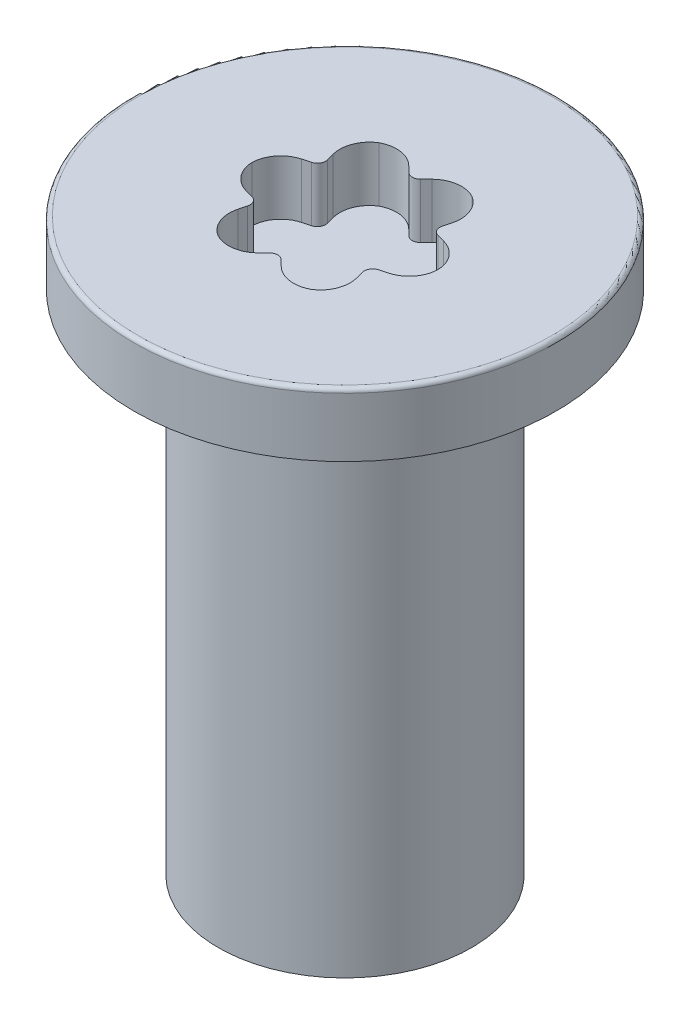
ISO-10303-21;
HEADER;
FILE_DESCRIPTION(('STEP AP214'),'2;1');
FILE_NAME('part.step','',(''),(''),'','','');
FILE_SCHEMA(('AUTOMOTIVE_DESIGN { 1 0 10303 214 1 1 1 1 }'));
ENDSEC;
DATA;
#1=APPLICATION_CONTEXT('core data for automotive mechanical design processes');
#2=APPLICATION_PROTOCOL_DEFINITION('international standard','automotive_design',2000,#1);
#3=PRODUCT_CONTEXT('',#1,'mechanical');
#4=PRODUCT('Part','Part','',(#3));
#5=PRODUCT_RELATED_PRODUCT_CATEGORY('part','',(#4));
#6=PRODUCT_DEFINITION_FORMATION('','',#4);
#7=PRODUCT_DEFINITION_CONTEXT('part definition',#1,'design');
#8=PRODUCT_DEFINITION('design','',#6,#7);
#9=PRODUCT_DEFINITION_SHAPE('','',#8);
#10=(LENGTH_UNIT() NAMED_UNIT(*) SI_UNIT(.MILLI.,.METRE.));
#11=(NAMED_UNIT(*) PLANE_ANGLE_UNIT() SI_UNIT($,.RADIAN.));
#12=(NAMED_UNIT(*) SI_UNIT($,.STERADIAN.) SOLID_ANGLE_UNIT());
#13=UNCERTAINTY_MEASURE_WITH_UNIT(LENGTH_MEASURE(1.E-05),#10,'distance_accuracy_value','');
#14=(GEOMETRIC_REPRESENTATION_CONTEXT(3) GLOBAL_UNCERTAINTY_ASSIGNED_CONTEXT((#13)) GLOBAL_UNIT_ASSIGNED_CONTEXT((#10,
#11,#12)) REPRESENTATION_CONTEXT('',''));
#15=CARTESIAN_POINT('',(0.,0.,0.));
#16=DIRECTION('',(0.,0.,1.));
#17=DIRECTION('',(1.,0.,0.));
#18=AXIS2_PLACEMENT_3D('',#15,#16,#17);
#19=CARTESIAN_POINT('',(-4.9,13.5,0.));
#20=DIRECTION('',(0.,-1.,0.));
#21=DIRECTION('',(0.,0.,-1.));
#22=AXIS2_PLACEMENT_3D('',#19,#20,#21);
#23=PLANE('',#22);
#24=CARTESIAN_POINT('',(0.,13.5,0.));
#25=DIRECTION('',(0.,-1.,0.));
#26=DIRECTION('',(0.,0.,-1.));
#27=AXIS2_PLACEMENT_3D('',#24,#25,#26);
#28=CIRCLE('',#27,4.9);
#29=CARTESIAN_POINT('',(0.,13.5,-4.9));
#30=VERTEX_POINT('',#29);
#31=EDGE_CURVE('E459',#30,#30,#28,.T.);
#32=ORIENTED_EDGE('',*,*,#31,.F.);
#33=EDGE_LOOP('',(#32));
#34=FACE_BOUND('',#33,.T.);
#35=DIRECTION('',(0.258819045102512,0.,-0.965925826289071));
#36=VECTOR('',#35,1.);
#37=CARTESIAN_POINT('',(-1.03134917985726,13.5,-0.276349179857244));
#38=LINE('',#37,#36);
#39=CARTESIAN_POINT('',(-1.40773060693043,13.5,1.12832542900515));
#40=VERTEX_POINT('',#39);
#41=CARTESIAN_POINT('',(-1.359462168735,13.5,0.948185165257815));
#42=VERTEX_POINT('',#41);
#43=EDGE_CURVE('E442',#40,#42,#38,.T.);
#44=ORIENTED_EDGE('',*,*,#43,.T.);
#45=CARTESIAN_POINT('',(-1.55264733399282,13.5,0.896421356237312));
#46=DIRECTION('',(0.,-1.,0.));
#47=DIRECTION('',(0.,0.,-1.));
#48=AXIS2_PLACEMENT_3D('',#45,#46,#47);
#49=CIRCLE('',#48,0.2);
#50=CARTESIAN_POINT('',(-1.50088352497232,13.5,0.703236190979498));
#51=VERTEX_POINT('',#50);
#52=EDGE_CURVE('E377',#42,#51,#49,.F.);
#53=ORIENTED_EDGE('',*,*,#52,.T.);
#54=DIRECTION('',(-0.96592582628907,0.,-0.258819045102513));
#55=VECTOR('',#54,1.);
#56=CARTESIAN_POINT('',(-0.276349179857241,13.5,1.03134917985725));
#57=LINE('',#56,#55);
#58=CARTESIAN_POINT('',(-1.68102378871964,13.5,0.654967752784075));
#59=VERTEX_POINT('',#58);
#60=EDGE_CURVE('E252',#51,#59,#57,.T.);
#61=ORIENTED_EDGE('',*,*,#60,.T.);
#62=CARTESIAN_POINT('',(-1.49985045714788,13.5,-0.021180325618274));
#63=DIRECTION('',(0.,-1.,0.));
#64=DIRECTION('',(0.,0.,-1.));
#65=AXIS2_PLACEMENT_3D('',#62,#63,#64);
#66=CIRCLE('',#65,0.7);
#67=CARTESIAN_POINT('',(-2.19952995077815,13.5,0.));
#68=VERTEX_POINT('',#67);
#69=EDGE_CURVE('E238',#59,#68,#66,.T.);
#70=ORIENTED_EDGE('',*,*,#69,.T.);
#71=CARTESIAN_POINT('',(-1.49985045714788,13.5,0.0211803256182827));
#72=DIRECTION('',(0.,-1.,0.));
#73=DIRECTION('',(0.,0.,-1.));
#74=AXIS2_PLACEMENT_3D('',#71,#72,#73);
#75=CIRCLE('',#74,0.7);
#76=CARTESIAN_POINT('',(-1.68102378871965,13.5,-0.654967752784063));
#77=VERTEX_POINT('',#76);
#78=EDGE_CURVE('E233',#68,#77,#75,.T.);
#79=ORIENTED_EDGE('',*,*,#78,.T.);
#80=DIRECTION('',(0.965925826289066,0.,-0.25881904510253));
#81=VECTOR('',#80,1.);
#82=CARTESIAN_POINT('',(-0.276349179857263,13.5,-1.03134917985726));
#83=LINE('',#82,#81);
#84=CARTESIAN_POINT('',(-1.50088352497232,13.5,-0.703236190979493));
#85=VERTEX_POINT('',#84);
#86=EDGE_CURVE('E236',#77,#85,#83,.T.);
#87=ORIENTED_EDGE('',*,*,#86,.T.);
#88=CARTESIAN_POINT('',(-1.55264733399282,13.5,-0.896421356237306));
#89=DIRECTION('',(0.,-1.,0.));
#90=DIRECTION('',(0.,0.,-1.));
#91=AXIS2_PLACEMENT_3D('',#88,#89,#90);
#92=CIRCLE('',#91,0.2);
#93=CARTESIAN_POINT('',(-1.35946216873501,13.5,-0.948185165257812));
#94=VERTEX_POINT('',#93);
#95=EDGE_CURVE('E367',#85,#94,#92,.F.);
#96=ORIENTED_EDGE('',*,*,#95,.T.);
#97=DIRECTION('',(-0.258819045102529,0.,-0.965925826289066));
#98=VECTOR('',#97,1.);
#99=CARTESIAN_POINT('',(-1.03134917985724,13.5,0.276349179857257));
#100=LINE('',#99,#98);
#101=CARTESIAN_POINT('',(-1.40773060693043,13.5,-1.12832542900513));
#102=VERTEX_POINT('',#101);
#103=EDGE_CURVE('E253',#94,#102,#100,.T.);
#104=ORIENTED_EDGE('',*,*,#103,.T.);
#105=CARTESIAN_POINT('',(-0.731582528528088,13.5,-1.3094987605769));
#106=DIRECTION('',(0.,-1.,0.));
#107=DIRECTION('',(0.,0.,-1.));
#108=AXIS2_PLACEMENT_3D('',#105,#106,#107);
#109=CIRCLE('',#108,0.7);
#110=CARTESIAN_POINT('',(-1.09976497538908,13.5,-1.90484881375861));
#111=VERTEX_POINT('',#110);
#112=EDGE_CURVE('E344',#102,#111,#109,.T.);
#113=ORIENTED_EDGE('',*,*,#112,.T.);
#114=CARTESIAN_POINT('',(-0.768267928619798,13.5,-1.28831843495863));
#115=DIRECTION('',(0.,-1.,0.));
#116=DIRECTION('',(0.,0.,-1.));
#117=AXIS2_PLACEMENT_3D('',#114,#115,#116);
#118=CIRCLE('',#117,0.7);
#119=CARTESIAN_POINT('',(-0.273293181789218,13.5,-1.78329318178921));
#120=VERTEX_POINT('',#119);
#121=EDGE_CURVE('E342',#111,#120,#118,.T.);
#122=ORIENTED_EDGE('',*,*,#121,.T.);
#123=DIRECTION('',(0.707106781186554,0.,0.707106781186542));
#124=VECTOR('',#123,1.);
#125=CARTESIAN_POINT('',(0.755,13.5,-0.755000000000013));
#126=LINE('',#125,#124);
#127=CARTESIAN_POINT('',(-0.141421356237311,13.5,-1.65142135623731));
#128=VERTEX_POINT('',#127);
#129=EDGE_CURVE('E429',#120,#128,#126,.T.);
#130=ORIENTED_EDGE('',*,*,#129,.T.);
#131=CARTESIAN_POINT('',(0.,13.5,-1.79284271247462));
#132=DIRECTION('',(0.,-1.,0.));
#133=DIRECTION('',(0.,0.,-1.));
#134=AXIS2_PLACEMENT_3D('',#131,#132,#133);
#135=CIRCLE('',#134,0.2);
#136=CARTESIAN_POINT('',(0.141421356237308,13.5,-1.65142135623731));
#137=VERTEX_POINT('',#136);
#138=EDGE_CURVE('E369',#128,#137,#135,.F.);
#139=ORIENTED_EDGE('',*,*,#138,.T.);
#140=DIRECTION('',(0.707106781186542,0.,-0.707106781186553));
#141=VECTOR('',#140,1.);
#142=CARTESIAN_POINT('',(-0.755,13.5,-0.754999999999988));
#143=LINE('',#142,#141);
#144=CARTESIAN_POINT('',(0.273293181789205,13.5,-1.78329318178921));
#145=VERTEX_POINT('',#144);
#146=EDGE_CURVE('E349',#137,#145,#143,.T.);
#147=ORIENTED_EDGE('',*,*,#146,.T.);
#148=CARTESIAN_POINT('',(0.768267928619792,13.5,-1.28831843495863));
#149=DIRECTION('',(0.,-1.,0.));
#150=DIRECTION('',(0.,0.,-1.));
#151=AXIS2_PLACEMENT_3D('',#148,#149,#150);
#152=CIRCLE('',#151,0.7);
#153=CARTESIAN_POINT('',(1.09976497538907,13.5,-1.90484881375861));
#154=VERTEX_POINT('',#153);
#155=EDGE_CURVE('E340',#145,#154,#152,.T.);
#156=ORIENTED_EDGE('',*,*,#155,.T.);
#157=CARTESIAN_POINT('',(0.731582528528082,13.5,-1.30949876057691));
#158=DIRECTION('',(0.,-1.,0.));
#159=DIRECTION('',(0.,0.,-1.));
#160=AXIS2_PLACEMENT_3D('',#157,#158,#159);
#161=CIRCLE('',#160,0.7);
#162=CARTESIAN_POINT('',(1.40773060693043,13.5,-1.12832542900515));
#163=VERTEX_POINT('',#162);
#164=EDGE_CURVE('E338',#154,#163,#161,.T.);
#165=ORIENTED_EDGE('',*,*,#164,.T.);
#166=DIRECTION('',(-0.258819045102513,0.,0.96592582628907));
#167=VECTOR('',#166,1.);
#168=CARTESIAN_POINT('',(1.03134917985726,13.5,0.276349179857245));
#169=LINE('',#168,#167);
#170=CARTESIAN_POINT('',(1.35946216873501,13.5,-0.948185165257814));
#171=VERTEX_POINT('',#170);
#172=EDGE_CURVE('E456',#163,#171,#169,.T.);
#173=ORIENTED_EDGE('',*,*,#172,.T.);
#174=CARTESIAN_POINT('',(1.55264733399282,13.5,-0.896421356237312));
#175=DIRECTION('',(0.,-1.,0.));
#176=DIRECTION('',(0.,0.,-1.));
#177=AXIS2_PLACEMENT_3D('',#174,#175,#176);
#178=CIRCLE('',#177,0.2);
#179=CARTESIAN_POINT('',(1.50088352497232,13.5,-0.703236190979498));
#180=VERTEX_POINT('',#179);
#181=EDGE_CURVE('E371',#171,#180,#178,.F.);
#182=ORIENTED_EDGE('',*,*,#181,.T.);
#183=DIRECTION('',(0.96592582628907,0.,0.258819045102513));
#184=VECTOR('',#183,1.);
#185=CARTESIAN_POINT('',(0.276349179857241,13.5,-1.03134917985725));
#186=LINE('',#185,#184);
#187=CARTESIAN_POINT('',(1.68102378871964,13.5,-0.654967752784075));
#188=VERTEX_POINT('',#187);
#189=EDGE_CURVE('E454',#180,#188,#186,.T.);
#190=ORIENTED_EDGE('',*,*,#189,.T.);
#191=CARTESIAN_POINT('',(1.49985045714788,13.5,0.0211803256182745));
#192=DIRECTION('',(0.,-1.,0.));
#193=DIRECTION('',(0.,0.,-1.));
#194=AXIS2_PLACEMENT_3D('',#191,#192,#193);
#195=CIRCLE('',#194,0.7);
#196=CARTESIAN_POINT('',(2.19952995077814,13.5,0.));
#197=VERTEX_POINT('',#196);
#198=EDGE_CURVE('E336',#188,#197,#195,.T.);
#199=ORIENTED_EDGE('',*,*,#198,.T.);
#200=CARTESIAN_POINT('',(1.49985045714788,13.5,-0.0211803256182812));
#201=DIRECTION('',(0.,-1.,0.));
#202=DIRECTION('',(0.,0.,-1.));
#203=AXIS2_PLACEMENT_3D('',#200,#201,#202);
#204=CIRCLE('',#203,0.7);
#205=CARTESIAN_POINT('',(1.68102378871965,13.5,0.654967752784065));
#206=VERTEX_POINT('',#205);
#207=EDGE_CURVE('E334',#197,#206,#204,.T.);
#208=ORIENTED_EDGE('',*,*,#207,.T.);
#209=DIRECTION('',(-0.965925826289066,0.,0.258819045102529));
#210=VECTOR('',#209,1.);
#211=CARTESIAN_POINT('',(0.276349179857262,13.5,1.03134917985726));
#212=LINE('',#211,#210);
#213=CARTESIAN_POINT('',(1.50088352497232,13.5,0.703236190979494));
#214=VERTEX_POINT('',#213);
#215=EDGE_CURVE('E451',#206,#214,#212,.T.);
#216=ORIENTED_EDGE('',*,*,#215,.T.);
#217=CARTESIAN_POINT('',(1.55264733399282,13.5,0.896421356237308));
#218=DIRECTION('',(0.,-1.,0.));
#219=DIRECTION('',(0.,0.,-1.));
#220=AXIS2_PLACEMENT_3D('',#217,#218,#219);
#221=CIRCLE('',#220,0.2);
#222=CARTESIAN_POINT('',(1.35946216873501,13.5,0.948185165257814));
#223=VERTEX_POINT('',#222);
#224=EDGE_CURVE('E373',#214,#223,#221,.F.);
#225=ORIENTED_EDGE('',*,*,#224,.T.);
#226=DIRECTION('',(0.258819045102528,0.,0.965925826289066));
#227=VECTOR('',#226,1.);
#228=CARTESIAN_POINT('',(1.03134917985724,13.5,-0.276349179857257));
#229=LINE('',#228,#227);
#230=CARTESIAN_POINT('',(1.40773060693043,13.5,1.12832542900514));
#231=VERTEX_POINT('',#230);
#232=EDGE_CURVE('E449',#223,#231,#229,.T.);
#233=ORIENTED_EDGE('',*,*,#232,.T.);
#234=CARTESIAN_POINT('',(0.731582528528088,13.5,1.3094987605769));
#235=DIRECTION('',(0.,-1.,0.));
#236=DIRECTION('',(0.,0.,-1.));
#237=AXIS2_PLACEMENT_3D('',#234,#235,#236);
#238=CIRCLE('',#237,0.7);
#239=CARTESIAN_POINT('',(1.09976497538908,13.5,1.90484881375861));
#240=VERTEX_POINT('',#239);
#241=EDGE_CURVE('E332',#231,#240,#238,.T.);
#242=ORIENTED_EDGE('',*,*,#241,.T.);
#243=CARTESIAN_POINT('',(0.768267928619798,13.5,1.28831843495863));
#244=DIRECTION('',(0.,-1.,0.));
#245=DIRECTION('',(0.,0.,-1.));
#246=AXIS2_PLACEMENT_3D('',#243,#244,#245);
#247=CIRCLE('',#246,0.7);
#248=CARTESIAN_POINT('',(0.273293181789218,13.5,1.78329318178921));
#249=VERTEX_POINT('',#248);
#250=EDGE_CURVE('E330',#240,#249,#247,.T.);
#251=ORIENTED_EDGE('',*,*,#250,.T.);
#252=DIRECTION('',(-0.707106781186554,0.,-0.707106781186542));
#253=VECTOR('',#252,1.);
#254=CARTESIAN_POINT('',(-0.755,13.5,0.755000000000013));
#255=LINE('',#254,#253);
#256=CARTESIAN_POINT('',(0.141421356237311,13.5,1.65142135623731));
#257=VERTEX_POINT('',#256);
#258=EDGE_CURVE('E446',#249,#257,#255,.T.);
#259=ORIENTED_EDGE('',*,*,#258,.T.);
#260=CARTESIAN_POINT('',(0.,13.5,1.79284271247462));
#261=DIRECTION('',(0.,-1.,0.));
#262=DIRECTION('',(0.,0.,-1.));
#263=AXIS2_PLACEMENT_3D('',#260,#261,#262);
#264=CIRCLE('',#263,0.2);
#265=CARTESIAN_POINT('',(-0.141421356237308,13.5,1.65142135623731));
#266=VERTEX_POINT('',#265);
#267=EDGE_CURVE('E375',#257,#266,#264,.F.);
#268=ORIENTED_EDGE('',*,*,#267,.T.);
#269=DIRECTION('',(-0.707106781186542,0.,0.707106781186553));
#270=VECTOR('',#269,1.);
#271=CARTESIAN_POINT('',(0.755,13.5,0.754999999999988));
#272=LINE('',#271,#270);
#273=CARTESIAN_POINT('',(-0.273293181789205,13.5,1.78329318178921));
#274=VERTEX_POINT('',#273);
#275=EDGE_CURVE('E444',#266,#274,#272,.T.);
#276=ORIENTED_EDGE('',*,*,#275,.T.);
#277=CARTESIAN_POINT('',(-0.768267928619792,13.5,1.28831843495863));
#278=DIRECTION('',(0.,-1.,0.));
#279=DIRECTION('',(0.,0.,-1.));
#280=AXIS2_PLACEMENT_3D('',#277,#278,#279);
#281=CIRCLE('',#280,0.7);
#282=CARTESIAN_POINT('',(-1.09976497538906,13.5,1.90484881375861));
#283=VERTEX_POINT('',#282);
#284=EDGE_CURVE('E328',#274,#283,#281,.T.);
#285=ORIENTED_EDGE('',*,*,#284,.T.);
#286=CARTESIAN_POINT('',(-0.731582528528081,13.5,1.30949876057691));
#287=DIRECTION('',(0.,-1.,0.));
#288=DIRECTION('',(0.,0.,-1.));
#289=AXIS2_PLACEMENT_3D('',#286,#287,#288);
#290=CIRCLE('',#289,0.7);
#291=EDGE_CURVE('E326',#283,#40,#290,.T.);
#292=ORIENTED_EDGE('',*,*,#291,.T.);
#293=EDGE_LOOP('',(#44,#53,#61,#70,#79,#87,#96,#104,#113,#122,#130,#139,#147,#156,#165,#173,
#182,#190,#199,#208,#216,#225,#233,#242,#251,#259,#268,#276,#285,#292));
#294=FACE_BOUND('',#293,.T.);
#295=ADVANCED_FACE('F36',(#34,#294),#23,.F.);
#296=CARTESIAN_POINT('',(0.,0.,0.));
#297=DIRECTION('',(0.,1.,0.));
#298=DIRECTION('',(0.,0.,1.));
#299=AXIS2_PLACEMENT_3D('',#296,#297,#298);
#300=PLANE('',#299);
#301=CARTESIAN_POINT('',(0.,0.,0.));
#302=DIRECTION('',(0.,-1.,0.));
#303=DIRECTION('',(0.,0.,-1.));
#304=AXIS2_PLACEMENT_3D('',#301,#302,#303);
#305=CIRCLE('',#304,3.);
#306=CARTESIAN_POINT('',(0.,0.,-3.));
#307=VERTEX_POINT('',#306);
#308=EDGE_CURVE('E258',#307,#307,#305,.T.);
#309=ORIENTED_EDGE('',*,*,#308,.T.);
#310=EDGE_LOOP('',(#309));
#311=FACE_BOUND('',#310,.T.);
#312=ADVANCED_FACE('F491',(#311),#300,.F.);
#313=CARTESIAN_POINT('',(0.,0.,0.));
#314=DIRECTION('',(0.,-1.,0.));
#315=DIRECTION('',(0.,0.,-1.));
#316=AXIS2_PLACEMENT_3D('',#313,#314,#315);
#317=CYLINDRICAL_SURFACE('',#316,3.);
#318=ORIENTED_EDGE('',*,*,#308,.F.);
#319=EDGE_LOOP('',(#318));
#320=FACE_BOUND('',#319,.T.);
#321=CARTESIAN_POINT('',(0.,12.,0.));
#322=DIRECTION('',(0.,-1.,0.));
#323=DIRECTION('',(0.,0.,-1.));
#324=AXIS2_PLACEMENT_3D('',#321,#322,#323);
#325=CIRCLE('',#324,3.);
#326=CARTESIAN_POINT('',(0.,12.,-3.));
#327=VERTEX_POINT('',#326);
#328=EDGE_CURVE('E264',#327,#327,#325,.T.);
#329=ORIENTED_EDGE('',*,*,#328,.T.);
#330=EDGE_LOOP('',(#329));
#331=FACE_BOUND('',#330,.T.);
#332=ADVANCED_FACE('F470',(#320,#331),#317,.T.);
#333=CARTESIAN_POINT('',(-3.,12.,0.));
#334=DIRECTION('',(0.,1.,0.));
#335=DIRECTION('',(0.,0.,1.));
#336=AXIS2_PLACEMENT_3D('',#333,#334,#335);
#337=PLANE('',#336);
#338=ORIENTED_EDGE('',*,*,#328,.F.);
#339=EDGE_LOOP('',(#338));
#340=FACE_BOUND('',#339,.T.);
#341=CARTESIAN_POINT('',(0.,12.,0.));
#342=DIRECTION('',(0.,-1.,0.));
#343=DIRECTION('',(0.,0.,-1.));
#344=AXIS2_PLACEMENT_3D('',#341,#342,#343);
#345=CIRCLE('',#344,5.);
#346=CARTESIAN_POINT('',(0.,12.,-5.));
#347=VERTEX_POINT('',#346);
#348=EDGE_CURVE('E465',#347,#347,#345,.T.);
#349=ORIENTED_EDGE('',*,*,#348,.T.);
#350=EDGE_LOOP('',(#349));
#351=FACE_BOUND('',#350,.T.);
#352=ADVANCED_FACE('F472',(#340,#351),#337,.F.);
#353=CARTESIAN_POINT('',(0.,0.,0.));
#354=DIRECTION('',(0.,-1.,0.));
#355=DIRECTION('',(0.,0.,-1.));
#356=AXIS2_PLACEMENT_3D('',#353,#354,#355);
#357=CYLINDRICAL_SURFACE('',#356,5.);
#358=ORIENTED_EDGE('',*,*,#348,.F.);
#359=EDGE_LOOP('',(#358));
#360=FACE_BOUND('',#359,.T.);
#361=CARTESIAN_POINT('',(0.,13.4,0.));
#362=DIRECTION('',(0.,-1.,0.));
#363=DIRECTION('',(0.,0.,-1.));
#364=AXIS2_PLACEMENT_3D('',#361,#362,#363);
#365=CIRCLE('',#364,5.);
#366=CARTESIAN_POINT('',(0.,13.4,-5.));
#367=VERTEX_POINT('',#366);
#368=EDGE_CURVE('E462',#367,#367,#365,.T.);
#369=ORIENTED_EDGE('',*,*,#368,.T.);
#370=EDGE_LOOP('',(#369));
#371=FACE_BOUND('',#370,.T.);
#372=ADVANCED_FACE('F475',(#360,#371),#357,.T.);
#373=CARTESIAN_POINT('',(0.,13.4,0.));
#374=DIRECTION('',(0.,-1.,0.));
#375=DIRECTION('',(0.,0.,-1.));
#376=AXIS2_PLACEMENT_3D('',#373,#374,#375);
#377=TOROIDAL_SURFACE('',#376,4.9,0.0999999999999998);
#378=ORIENTED_EDGE('',*,*,#368,.F.);
#379=EDGE_LOOP('',(#378));
#380=FACE_BOUND('',#379,.T.);
#381=ORIENTED_EDGE('',*,*,#31,.T.);
#382=EDGE_LOOP('',(#381));
#383=FACE_BOUND('',#382,.T.);
#384=ADVANCED_FACE('F481',(#380,#383),#377,.T.);
#385=CARTESIAN_POINT('',(-0.755,12.2,-0.754999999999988));
#386=DIRECTION('',(0.707106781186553,0.,0.707106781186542));
#387=DIRECTION('',(0.707106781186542,0.,-0.707106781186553));
#388=AXIS2_PLACEMENT_3D('',#385,#386,#387);
#389=PLANE('',#388);
#390=ORIENTED_EDGE('',*,*,#146,.F.);
#391=DIRECTION('',(0.,1.,0.));
#392=VECTOR('',#391,1.);
#393=CARTESIAN_POINT('',(0.141421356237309,12.2,-1.65142135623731));
#394=LINE('',#393,#392);
#395=CARTESIAN_POINT('',(0.141421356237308,12.2,-1.65142135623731));
#396=VERTEX_POINT('',#395);
#397=EDGE_CURVE('E399',#137,#396,#394,.F.);
#398=ORIENTED_EDGE('',*,*,#397,.T.);
#399=DIRECTION('',(0.707106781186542,0.,-0.707106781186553));
#400=VECTOR('',#399,1.);
#401=CARTESIAN_POINT('',(-0.755,12.2,-0.754999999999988));
#402=LINE('',#401,#400);
#403=CARTESIAN_POINT('',(0.273293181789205,12.2,-1.78329318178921));
#404=VERTEX_POINT('',#403);
#405=EDGE_CURVE('E416',#396,#404,#402,.T.);
#406=ORIENTED_EDGE('',*,*,#405,.T.);
#407=DIRECTION('',(0.,1.,0.));
#408=VECTOR('',#407,1.);
#409=CARTESIAN_POINT('',(0.273293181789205,12.2,-1.78329318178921));
#410=LINE('',#409,#408);
#411=EDGE_CURVE('E317',#404,#145,#410,.T.);
#412=ORIENTED_EDGE('',*,*,#411,.T.);
#413=EDGE_LOOP('',(#390,#398,#406,#412));
#414=FACE_BOUND('',#413,.T.);
#415=ADVANCED_FACE('F431',(#414),#389,.T.);
#416=CARTESIAN_POINT('',(1.03134917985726,12.2,0.276349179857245));
#417=DIRECTION('',(-0.96592582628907,0.,-0.258819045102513));
#418=DIRECTION('',(-0.258819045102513,0.,0.96592582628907));
#419=AXIS2_PLACEMENT_3D('',#416,#417,#418);
#420=PLANE('',#419);
#421=DIRECTION('',(-0.258819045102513,0.,0.96592582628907));
#422=VECTOR('',#421,1.);
#423=CARTESIAN_POINT('',(1.03134917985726,12.2,0.276349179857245));
#424=LINE('',#423,#422);
#425=CARTESIAN_POINT('',(1.40773060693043,12.2,-1.12832542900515));
#426=VERTEX_POINT('',#425);
#427=CARTESIAN_POINT('',(1.35946216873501,12.2,-0.948185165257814));
#428=VERTEX_POINT('',#427);
#429=EDGE_CURVE('E437',#426,#428,#424,.T.);
#430=ORIENTED_EDGE('',*,*,#429,.T.);
#431=DIRECTION('',(0.,1.,0.));
#432=VECTOR('',#431,1.);
#433=CARTESIAN_POINT('',(1.35946216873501,12.2,-0.948185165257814));
#434=LINE('',#433,#432);
#435=EDGE_CURVE('E391',#428,#171,#434,.T.);
#436=ORIENTED_EDGE('',*,*,#435,.T.);
#437=ORIENTED_EDGE('',*,*,#172,.F.);
#438=DIRECTION('',(0.,1.,0.));
#439=VECTOR('',#438,1.);
#440=CARTESIAN_POINT('',(1.40773060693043,12.2,-1.12832542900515));
#441=LINE('',#440,#439);
#442=EDGE_CURVE('E314',#163,#426,#441,.F.);
#443=ORIENTED_EDGE('',*,*,#442,.T.);
#444=EDGE_LOOP('',(#430,#436,#437,#443));
#445=FACE_BOUND('',#444,.T.);
#446=ADVANCED_FACE('F604',(#445),#420,.T.);
#447=CARTESIAN_POINT('',(0.276349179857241,12.2,-1.03134917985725));
#448=DIRECTION('',(-0.258819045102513,0.,0.96592582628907));
#449=DIRECTION('',(0.96592582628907,0.,0.258819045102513));
#450=AXIS2_PLACEMENT_3D('',#447,#448,#449);
#451=PLANE('',#450);
#452=ORIENTED_EDGE('',*,*,#189,.F.);
#453=DIRECTION('',(0.,1.,0.));
#454=VECTOR('',#453,1.);
#455=CARTESIAN_POINT('',(1.50088352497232,12.2,-0.703236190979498));
#456=LINE('',#455,#454);
#457=CARTESIAN_POINT('',(1.50088352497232,12.2,-0.703236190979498));
#458=VERTEX_POINT('',#457);
#459=EDGE_CURVE('E394',#180,#458,#456,.F.);
#460=ORIENTED_EDGE('',*,*,#459,.T.);
#461=DIRECTION('',(0.96592582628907,0.,0.258819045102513));
#462=VECTOR('',#461,1.);
#463=CARTESIAN_POINT('',(0.276349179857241,12.2,-1.03134917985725));
#464=LINE('',#463,#462);
#465=CARTESIAN_POINT('',(1.68102378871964,12.2,-0.654967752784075));
#466=VERTEX_POINT('',#465);
#467=EDGE_CURVE('E597',#458,#466,#464,.T.);
#468=ORIENTED_EDGE('',*,*,#467,.T.);
#469=DIRECTION('',(0.,1.,0.));
#470=VECTOR('',#469,1.);
#471=CARTESIAN_POINT('',(1.68102378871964,12.2,-0.654967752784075));
#472=LINE('',#471,#470);
#473=EDGE_CURVE('E311',#466,#188,#472,.T.);
#474=ORIENTED_EDGE('',*,*,#473,.T.);
#475=EDGE_LOOP('',(#452,#460,#468,#474));
#476=FACE_BOUND('',#475,.T.);
#477=ADVANCED_FACE('F610',(#476),#451,.T.);
#478=CARTESIAN_POINT('',(0.276349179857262,12.2,1.03134917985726));
#479=DIRECTION('',(-0.258819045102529,0.,-0.965925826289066));
#480=DIRECTION('',(-0.965925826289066,0.,0.258819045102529));
#481=AXIS2_PLACEMENT_3D('',#478,#479,#480);
#482=PLANE('',#481);
#483=DIRECTION('',(-0.965925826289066,0.,0.258819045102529));
#484=VECTOR('',#483,1.);
#485=CARTESIAN_POINT('',(0.276349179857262,12.2,1.03134917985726));
#486=LINE('',#485,#484);
#487=CARTESIAN_POINT('',(1.68102378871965,12.2,0.654967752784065));
#488=VERTEX_POINT('',#487);
#489=CARTESIAN_POINT('',(1.50088352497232,12.2,0.703236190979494));
#490=VERTEX_POINT('',#489);
#491=EDGE_CURVE('E595',#488,#490,#486,.T.);
#492=ORIENTED_EDGE('',*,*,#491,.T.);
#493=DIRECTION('',(0.,1.,0.));
#494=VECTOR('',#493,1.);
#495=CARTESIAN_POINT('',(1.50088352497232,12.2,0.703236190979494));
#496=LINE('',#495,#494);
#497=EDGE_CURVE('E386',#490,#214,#496,.T.);
#498=ORIENTED_EDGE('',*,*,#497,.T.);
#499=ORIENTED_EDGE('',*,*,#215,.F.);
#500=DIRECTION('',(0.,1.,0.));
#501=VECTOR('',#500,1.);
#502=CARTESIAN_POINT('',(1.68102378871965,12.2,0.654967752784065));
#503=LINE('',#502,#501);
#504=EDGE_CURVE('E308',#206,#488,#503,.F.);
#505=ORIENTED_EDGE('',*,*,#504,.T.);
#506=EDGE_LOOP('',(#492,#498,#499,#505));
#507=FACE_BOUND('',#506,.T.);
#508=ADVANCED_FACE('F619',(#507),#482,.T.);
#509=CARTESIAN_POINT('',(1.03134917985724,12.2,-0.276349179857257));
#510=DIRECTION('',(-0.965925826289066,0.,0.258819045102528));
#511=DIRECTION('',(0.258819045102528,0.,0.965925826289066));
#512=AXIS2_PLACEMENT_3D('',#509,#510,#511);
#513=PLANE('',#512);
#514=ORIENTED_EDGE('',*,*,#232,.F.);
#515=DIRECTION('',(0.,1.,0.));
#516=VECTOR('',#515,1.);
#517=CARTESIAN_POINT('',(1.35946216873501,12.2,0.948185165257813));
#518=LINE('',#517,#516);
#519=CARTESIAN_POINT('',(1.35946216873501,12.2,0.948185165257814));
#520=VERTEX_POINT('',#519);
#521=EDGE_CURVE('E389',#223,#520,#518,.F.);
#522=ORIENTED_EDGE('',*,*,#521,.T.);
#523=DIRECTION('',(0.258819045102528,0.,0.965925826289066));
#524=VECTOR('',#523,1.);
#525=CARTESIAN_POINT('',(1.03134917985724,12.2,-0.276349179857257));
#526=LINE('',#525,#524);
#527=CARTESIAN_POINT('',(1.40773060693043,12.2,1.12832542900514));
#528=VERTEX_POINT('',#527);
#529=EDGE_CURVE('E593',#520,#528,#526,.T.);
#530=ORIENTED_EDGE('',*,*,#529,.T.);
#531=DIRECTION('',(0.,1.,0.));
#532=VECTOR('',#531,1.);
#533=CARTESIAN_POINT('',(1.40773060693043,12.2,1.12832542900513));
#534=LINE('',#533,#532);
#535=EDGE_CURVE('E305',#528,#231,#534,.T.);
#536=ORIENTED_EDGE('',*,*,#535,.T.);
#537=EDGE_LOOP('',(#514,#522,#530,#536));
#538=FACE_BOUND('',#537,.T.);
#539=ADVANCED_FACE('F627',(#538),#513,.T.);
#540=CARTESIAN_POINT('',(-0.755,12.2,0.755000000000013));
#541=DIRECTION('',(0.707106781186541,0.,-0.707106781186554));
#542=DIRECTION('',(-0.707106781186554,0.,-0.707106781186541));
#543=AXIS2_PLACEMENT_3D('',#540,#541,#542);
#544=PLANE('',#543);
#545=DIRECTION('',(-0.707106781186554,0.,-0.707106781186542));
#546=VECTOR('',#545,1.);
#547=CARTESIAN_POINT('',(-0.755,12.2,0.755000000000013));
#548=LINE('',#547,#546);
#549=CARTESIAN_POINT('',(0.273293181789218,12.2,1.78329318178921));
#550=VERTEX_POINT('',#549);
#551=CARTESIAN_POINT('',(0.141421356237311,12.2,1.65142135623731));
#552=VERTEX_POINT('',#551);
#553=EDGE_CURVE('E590',#550,#552,#548,.T.);
#554=ORIENTED_EDGE('',*,*,#553,.T.);
#555=DIRECTION('',(0.,1.,0.));
#556=VECTOR('',#555,1.);
#557=CARTESIAN_POINT('',(0.141421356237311,12.2,1.65142135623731));
#558=LINE('',#557,#556);
#559=EDGE_CURVE('E381',#552,#257,#558,.T.);
#560=ORIENTED_EDGE('',*,*,#559,.T.);
#561=ORIENTED_EDGE('',*,*,#258,.F.);
#562=DIRECTION('',(0.,1.,0.));
#563=VECTOR('',#562,1.);
#564=CARTESIAN_POINT('',(0.273293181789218,12.2,1.78329318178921));
#565=LINE('',#564,#563);
#566=EDGE_CURVE('E302',#249,#550,#565,.F.);
#567=ORIENTED_EDGE('',*,*,#566,.T.);
#568=EDGE_LOOP('',(#554,#560,#561,#567));
#569=FACE_BOUND('',#568,.T.);
#570=ADVANCED_FACE('F636',(#569),#544,.T.);
#571=CARTESIAN_POINT('',(0.755,12.2,0.754999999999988));
#572=DIRECTION('',(-0.707106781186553,0.,-0.707106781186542));
#573=DIRECTION('',(-0.707106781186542,0.,0.707106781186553));
#574=AXIS2_PLACEMENT_3D('',#571,#572,#573);
#575=PLANE('',#574);
#576=ORIENTED_EDGE('',*,*,#275,.F.);
#577=DIRECTION('',(0.,1.,0.));
#578=VECTOR('',#577,1.);
#579=CARTESIAN_POINT('',(-0.141421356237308,12.2,1.65142135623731));
#580=LINE('',#579,#578);
#581=CARTESIAN_POINT('',(-0.141421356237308,12.2,1.65142135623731));
#582=VERTEX_POINT('',#581);
#583=EDGE_CURVE('E384',#266,#582,#580,.F.);
#584=ORIENTED_EDGE('',*,*,#583,.T.);
#585=DIRECTION('',(-0.707106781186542,0.,0.707106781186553));
#586=VECTOR('',#585,1.);
#587=CARTESIAN_POINT('',(0.755,12.2,0.754999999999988));
#588=LINE('',#587,#586);
#589=CARTESIAN_POINT('',(-0.273293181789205,12.2,1.78329318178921));
#590=VERTEX_POINT('',#589);
#591=EDGE_CURVE('E588',#582,#590,#588,.T.);
#592=ORIENTED_EDGE('',*,*,#591,.T.);
#593=DIRECTION('',(0.,1.,0.));
#594=VECTOR('',#593,1.);
#595=CARTESIAN_POINT('',(-0.273293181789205,12.2,1.78329318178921));
#596=LINE('',#595,#594);
#597=EDGE_CURVE('E299',#590,#274,#596,.T.);
#598=ORIENTED_EDGE('',*,*,#597,.T.);
#599=EDGE_LOOP('',(#576,#584,#592,#598));
#600=FACE_BOUND('',#599,.T.);
#601=ADVANCED_FACE('F644',(#600),#575,.T.);
#602=CARTESIAN_POINT('',(-1.03134917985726,12.2,-0.276349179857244));
#603=DIRECTION('',(0.965925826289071,0.,0.258819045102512));
#604=DIRECTION('',(0.258819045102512,0.,-0.965925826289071));
#605=AXIS2_PLACEMENT_3D('',#602,#603,#604);
#606=PLANE('',#605);
#607=DIRECTION('',(0.258819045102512,0.,-0.965925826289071));
#608=VECTOR('',#607,1.);
#609=CARTESIAN_POINT('',(-1.03134917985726,12.2,-0.276349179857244));
#610=LINE('',#609,#608);
#611=CARTESIAN_POINT('',(-1.40773060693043,12.2,1.12832542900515));
#612=VERTEX_POINT('',#611);
#613=CARTESIAN_POINT('',(-1.359462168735,12.2,0.948185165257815));
#614=VERTEX_POINT('',#613);
#615=EDGE_CURVE('E585',#612,#614,#610,.T.);
#616=ORIENTED_EDGE('',*,*,#615,.T.);
#617=DIRECTION('',(0.,1.,0.));
#618=VECTOR('',#617,1.);
#619=CARTESIAN_POINT('',(-1.359462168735,12.2,0.948185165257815));
#620=LINE('',#619,#618);
#621=EDGE_CURVE('E346',#614,#42,#620,.T.);
#622=ORIENTED_EDGE('',*,*,#621,.T.);
#623=ORIENTED_EDGE('',*,*,#43,.F.);
#624=DIRECTION('',(0.,1.,0.));
#625=VECTOR('',#624,1.);
#626=CARTESIAN_POINT('',(-1.40773060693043,12.2,1.12832542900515));
#627=LINE('',#626,#625);
#628=EDGE_CURVE('E296',#40,#612,#627,.F.);
#629=ORIENTED_EDGE('',*,*,#628,.T.);
#630=EDGE_LOOP('',(#616,#622,#623,#629));
#631=FACE_BOUND('',#630,.T.);
#632=ADVANCED_FACE('F653',(#631),#606,.T.);
#633=CARTESIAN_POINT('',(-0.276349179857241,12.2,1.03134917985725));
#634=DIRECTION('',(0.258819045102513,0.,-0.96592582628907));
#635=DIRECTION('',(-0.96592582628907,0.,-0.258819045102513));
#636=AXIS2_PLACEMENT_3D('',#633,#634,#635);
#637=PLANE('',#636);
#638=ORIENTED_EDGE('',*,*,#60,.F.);
#639=DIRECTION('',(0.,1.,0.));
#640=VECTOR('',#639,1.);
#641=CARTESIAN_POINT('',(-1.50088352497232,12.2,0.703236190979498));
#642=LINE('',#641,#640);
#643=CARTESIAN_POINT('',(-1.50088352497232,12.2,0.703236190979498));
#644=VERTEX_POINT('',#643);
#645=EDGE_CURVE('E379',#51,#644,#642,.F.);
#646=ORIENTED_EDGE('',*,*,#645,.T.);
#647=DIRECTION('',(-0.96592582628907,0.,-0.258819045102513));
#648=VECTOR('',#647,1.);
#649=CARTESIAN_POINT('',(-0.276349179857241,12.2,1.03134917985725));
#650=LINE('',#649,#648);
#651=CARTESIAN_POINT('',(-1.68102378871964,12.2,0.654967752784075));
#652=VERTEX_POINT('',#651);
#653=EDGE_CURVE('E580',#644,#652,#650,.T.);
#654=ORIENTED_EDGE('',*,*,#653,.T.);
#655=DIRECTION('',(0.,1.,0.));
#656=VECTOR('',#655,1.);
#657=CARTESIAN_POINT('',(-1.68102378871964,12.2,0.654967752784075));
#658=LINE('',#657,#656);
#659=EDGE_CURVE('E293',#652,#59,#658,.T.);
#660=ORIENTED_EDGE('',*,*,#659,.T.);
#661=EDGE_LOOP('',(#638,#646,#654,#660));
#662=FACE_BOUND('',#661,.T.);
#663=ADVANCED_FACE('F661',(#662),#637,.T.);
#664=CARTESIAN_POINT('',(-0.276349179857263,12.2,-1.03134917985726));
#665=DIRECTION('',(0.25881904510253,0.,0.965925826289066));
#666=DIRECTION('',(0.965925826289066,0.,-0.25881904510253));
#667=AXIS2_PLACEMENT_3D('',#664,#665,#666);
#668=PLANE('',#667);
#669=DIRECTION('',(0.965925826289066,0.,-0.25881904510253));
#670=VECTOR('',#669,1.);
#671=CARTESIAN_POINT('',(-0.276349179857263,12.2,-1.03134917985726));
#672=LINE('',#671,#670);
#673=CARTESIAN_POINT('',(-1.68102378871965,12.2,-0.654967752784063));
#674=VERTEX_POINT('',#673);
#675=CARTESIAN_POINT('',(-1.50088352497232,12.2,-0.703236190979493));
#676=VERTEX_POINT('',#675);
#677=EDGE_CURVE('E578',#674,#676,#672,.T.);
#678=ORIENTED_EDGE('',*,*,#677,.T.);
#679=DIRECTION('',(0.,1.,0.));
#680=VECTOR('',#679,1.);
#681=CARTESIAN_POINT('',(-1.50088352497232,12.2,-0.703236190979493));
#682=LINE('',#681,#680);
#683=EDGE_CURVE('E251',#676,#85,#682,.T.);
#684=ORIENTED_EDGE('',*,*,#683,.T.);
#685=ORIENTED_EDGE('',*,*,#86,.F.);
#686=DIRECTION('',(0.,1.,0.));
#687=VECTOR('',#686,1.);
#688=CARTESIAN_POINT('',(-1.68102378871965,12.2,-0.654967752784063));
#689=LINE('',#688,#687);
#690=EDGE_CURVE('E249',#77,#674,#689,.F.);
#691=ORIENTED_EDGE('',*,*,#690,.T.);
#692=EDGE_LOOP('',(#678,#684,#685,#691));
#693=FACE_BOUND('',#692,.T.);
#694=ADVANCED_FACE('F248',(#693),#668,.T.);
#695=CARTESIAN_POINT('',(-1.03134917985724,12.2,0.276349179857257));
#696=DIRECTION('',(0.965925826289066,0.,-0.258819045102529));
#697=DIRECTION('',(-0.258819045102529,0.,-0.965925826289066));
#698=AXIS2_PLACEMENT_3D('',#695,#696,#697);
#699=PLANE('',#698);
#700=ORIENTED_EDGE('',*,*,#103,.F.);
#701=DIRECTION('',(0.,1.,0.));
#702=VECTOR('',#701,1.);
#703=CARTESIAN_POINT('',(-1.35946216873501,12.2,-0.948185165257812));
#704=LINE('',#703,#702);
#705=CARTESIAN_POINT('',(-1.35946216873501,12.2,-0.948185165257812));
#706=VERTEX_POINT('',#705);
#707=EDGE_CURVE('E51',#94,#706,#704,.F.);
#708=ORIENTED_EDGE('',*,*,#707,.T.);
#709=DIRECTION('',(-0.258819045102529,0.,-0.965925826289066));
#710=VECTOR('',#709,1.);
#711=CARTESIAN_POINT('',(-1.03134917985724,12.2,0.276349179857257));
#712=LINE('',#711,#710);
#713=CARTESIAN_POINT('',(-1.40773060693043,12.2,-1.12832542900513));
#714=VERTEX_POINT('',#713);
#715=EDGE_CURVE('E425',#706,#714,#712,.T.);
#716=ORIENTED_EDGE('',*,*,#715,.T.);
#717=DIRECTION('',(0.,1.,0.));
#718=VECTOR('',#717,1.);
#719=CARTESIAN_POINT('',(-1.40773060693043,12.2,-1.12832542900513));
#720=LINE('',#719,#718);
#721=EDGE_CURVE('E243',#714,#102,#720,.T.);
#722=ORIENTED_EDGE('',*,*,#721,.T.);
#723=EDGE_LOOP('',(#700,#708,#716,#722));
#724=FACE_BOUND('',#723,.T.);
#725=ADVANCED_FACE('F572',(#724),#699,.T.);
#726=CARTESIAN_POINT('',(0.755,12.2,-0.755000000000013));
#727=DIRECTION('',(-0.707106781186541,0.,0.707106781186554));
#728=DIRECTION('',(0.707106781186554,0.,0.707106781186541));
#729=AXIS2_PLACEMENT_3D('',#726,#727,#728);
#730=PLANE('',#729);
#731=DIRECTION('',(0.707106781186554,0.,0.707106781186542));
#732=VECTOR('',#731,1.);
#733=CARTESIAN_POINT('',(0.755,12.2,-0.755000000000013));
#734=LINE('',#733,#732);
#735=CARTESIAN_POINT('',(-0.273293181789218,12.2,-1.78329318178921));
#736=VERTEX_POINT('',#735);
#737=CARTESIAN_POINT('',(-0.141421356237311,12.2,-1.65142135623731));
#738=VERTEX_POINT('',#737);
#739=EDGE_CURVE('E415',#736,#738,#734,.T.);
#740=ORIENTED_EDGE('',*,*,#739,.T.);
#741=DIRECTION('',(0.,1.,0.));
#742=VECTOR('',#741,1.);
#743=CARTESIAN_POINT('',(-0.141421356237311,12.2,-1.65142135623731));
#744=LINE('',#743,#742);
#745=EDGE_CURVE('E396',#738,#128,#744,.T.);
#746=ORIENTED_EDGE('',*,*,#745,.T.);
#747=ORIENTED_EDGE('',*,*,#129,.F.);
#748=DIRECTION('',(0.,1.,0.));
#749=VECTOR('',#748,1.);
#750=CARTESIAN_POINT('',(-0.273293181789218,12.2,-1.78329318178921));
#751=LINE('',#750,#749);
#752=EDGE_CURVE('E320',#120,#736,#751,.F.);
#753=ORIENTED_EDGE('',*,*,#752,.T.);
#754=EDGE_LOOP('',(#740,#746,#747,#753));
#755=FACE_BOUND('',#754,.T.);
#756=ADVANCED_FACE('F421',(#755),#730,.T.);
#757=CARTESIAN_POINT('',(0.,12.2,0.));
#758=DIRECTION('',(0.,1.,0.));
#759=DIRECTION('',(0.,0.,1.));
#760=AXIS2_PLACEMENT_3D('',#757,#758,#759);
#761=PLANE('',#760);
#762=ORIENTED_EDGE('',*,*,#677,.F.);
#763=CARTESIAN_POINT('',(-1.49985045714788,12.2,0.0211803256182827));
#764=DIRECTION('',(0.,1.,0.));
#765=DIRECTION('',(0.,0.,1.));
#766=AXIS2_PLACEMENT_3D('',#763,#764,#765);
#767=CIRCLE('',#766,0.7);
#768=CARTESIAN_POINT('',(-2.19952995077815,12.2,0.));
#769=VERTEX_POINT('',#768);
#770=EDGE_CURVE('E256',#674,#769,#767,.T.);
#771=ORIENTED_EDGE('',*,*,#770,.T.);
#772=CARTESIAN_POINT('',(-1.49985045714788,12.2,-0.021180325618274));
#773=DIRECTION('',(0.,1.,0.));
#774=DIRECTION('',(0.,0.,1.));
#775=AXIS2_PLACEMENT_3D('',#772,#773,#774);
#776=CIRCLE('',#775,0.7);
#777=EDGE_CURVE('E289',#769,#652,#776,.T.);
#778=ORIENTED_EDGE('',*,*,#777,.T.);
#779=ORIENTED_EDGE('',*,*,#653,.F.);
#780=CARTESIAN_POINT('',(-1.55264733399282,12.2,0.896421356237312));
#781=DIRECTION('',(0.,1.,0.));
#782=DIRECTION('',(0.,0.,1.));
#783=AXIS2_PLACEMENT_3D('',#780,#781,#782);
#784=CIRCLE('',#783,0.2);
#785=EDGE_CURVE('E403',#644,#614,#784,.F.);
#786=ORIENTED_EDGE('',*,*,#785,.T.);
#787=ORIENTED_EDGE('',*,*,#615,.F.);
#788=CARTESIAN_POINT('',(-0.731582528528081,12.2,1.30949876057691));
#789=DIRECTION('',(0.,1.,0.));
#790=DIRECTION('',(0.,0.,1.));
#791=AXIS2_PLACEMENT_3D('',#788,#789,#790);
#792=CIRCLE('',#791,0.7);
#793=CARTESIAN_POINT('',(-1.09976497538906,12.2,1.90484881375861));
#794=VERTEX_POINT('',#793);
#795=EDGE_CURVE('E287',#612,#794,#792,.T.);
#796=ORIENTED_EDGE('',*,*,#795,.T.);
#797=CARTESIAN_POINT('',(-0.768267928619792,12.2,1.28831843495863));
#798=DIRECTION('',(0.,1.,0.));
#799=DIRECTION('',(0.,0.,1.));
#800=AXIS2_PLACEMENT_3D('',#797,#798,#799);
#801=CIRCLE('',#800,0.7);
#802=EDGE_CURVE('E284',#794,#590,#801,.T.);
#803=ORIENTED_EDGE('',*,*,#802,.T.);
#804=ORIENTED_EDGE('',*,*,#591,.F.);
#805=CARTESIAN_POINT('',(0.,12.2,1.79284271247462));
#806=DIRECTION('',(0.,1.,0.));
#807=DIRECTION('',(0.,0.,1.));
#808=AXIS2_PLACEMENT_3D('',#805,#806,#807);
#809=CIRCLE('',#808,0.2);
#810=EDGE_CURVE('E405',#582,#552,#809,.F.);
#811=ORIENTED_EDGE('',*,*,#810,.T.);
#812=ORIENTED_EDGE('',*,*,#553,.F.);
#813=CARTESIAN_POINT('',(0.768267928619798,12.2,1.28831843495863));
#814=DIRECTION('',(0.,1.,0.));
#815=DIRECTION('',(0.,0.,1.));
#816=AXIS2_PLACEMENT_3D('',#813,#814,#815);
#817=CIRCLE('',#816,0.7);
#818=CARTESIAN_POINT('',(1.09976497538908,12.2,1.90484881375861));
#819=VERTEX_POINT('',#818);
#820=EDGE_CURVE('E282',#550,#819,#817,.T.);
#821=ORIENTED_EDGE('',*,*,#820,.T.);
#822=CARTESIAN_POINT('',(0.731582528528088,12.2,1.3094987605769));
#823=DIRECTION('',(0.,1.,0.));
#824=DIRECTION('',(0.,0.,1.));
#825=AXIS2_PLACEMENT_3D('',#822,#823,#824);
#826=CIRCLE('',#825,0.7);
#827=EDGE_CURVE('E279',#819,#528,#826,.T.);
#828=ORIENTED_EDGE('',*,*,#827,.T.);
#829=ORIENTED_EDGE('',*,*,#529,.F.);
#830=CARTESIAN_POINT('',(1.55264733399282,12.2,0.896421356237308));
#831=DIRECTION('',(0.,1.,0.));
#832=DIRECTION('',(0.,0.,1.));
#833=AXIS2_PLACEMENT_3D('',#830,#831,#832);
#834=CIRCLE('',#833,0.2);
#835=EDGE_CURVE('E407',#520,#490,#834,.F.);
#836=ORIENTED_EDGE('',*,*,#835,.T.);
#837=ORIENTED_EDGE('',*,*,#491,.F.);
#838=CARTESIAN_POINT('',(1.49985045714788,12.2,-0.0211803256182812));
#839=DIRECTION('',(0.,1.,0.));
#840=DIRECTION('',(0.,0.,1.));
#841=AXIS2_PLACEMENT_3D('',#838,#839,#840);
#842=CIRCLE('',#841,0.7);
#843=CARTESIAN_POINT('',(2.19952995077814,12.2,0.));
#844=VERTEX_POINT('',#843);
#845=EDGE_CURVE('E277',#488,#844,#842,.T.);
#846=ORIENTED_EDGE('',*,*,#845,.T.);
#847=CARTESIAN_POINT('',(1.49985045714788,12.2,0.0211803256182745));
#848=DIRECTION('',(0.,1.,0.));
#849=DIRECTION('',(0.,0.,1.));
#850=AXIS2_PLACEMENT_3D('',#847,#848,#849);
#851=CIRCLE('',#850,0.7);
#852=EDGE_CURVE('E274',#844,#466,#851,.T.);
#853=ORIENTED_EDGE('',*,*,#852,.T.);
#854=ORIENTED_EDGE('',*,*,#467,.F.);
#855=CARTESIAN_POINT('',(1.55264733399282,12.2,-0.896421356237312));
#856=DIRECTION('',(0.,1.,0.));
#857=DIRECTION('',(0.,0.,1.));
#858=AXIS2_PLACEMENT_3D('',#855,#856,#857);
#859=CIRCLE('',#858,0.2);
#860=EDGE_CURVE('E409',#458,#428,#859,.F.);
#861=ORIENTED_EDGE('',*,*,#860,.T.);
#862=ORIENTED_EDGE('',*,*,#429,.F.);
#863=CARTESIAN_POINT('',(0.731582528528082,12.2,-1.30949876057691));
#864=DIRECTION('',(0.,1.,0.));
#865=DIRECTION('',(0.,0.,1.));
#866=AXIS2_PLACEMENT_3D('',#863,#864,#865);
#867=CIRCLE('',#866,0.7);
#868=CARTESIAN_POINT('',(1.09976497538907,12.2,-1.90484881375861));
#869=VERTEX_POINT('',#868);
#870=EDGE_CURVE('E272',#426,#869,#867,.T.);
#871=ORIENTED_EDGE('',*,*,#870,.T.);
#872=CARTESIAN_POINT('',(0.768267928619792,12.2,-1.28831843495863));
#873=DIRECTION('',(0.,1.,0.));
#874=DIRECTION('',(0.,0.,1.));
#875=AXIS2_PLACEMENT_3D('',#872,#873,#874);
#876=CIRCLE('',#875,0.7);
#877=EDGE_CURVE('E269',#869,#404,#876,.T.);
#878=ORIENTED_EDGE('',*,*,#877,.T.);
#879=ORIENTED_EDGE('',*,*,#405,.F.);
#880=CARTESIAN_POINT('',(0.,12.2,-1.79284271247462));
#881=DIRECTION('',(0.,1.,0.));
#882=DIRECTION('',(0.,0.,1.));
#883=AXIS2_PLACEMENT_3D('',#880,#881,#882);
#884=CIRCLE('',#883,0.2);
#885=EDGE_CURVE('E44',#396,#738,#884,.F.);
#886=ORIENTED_EDGE('',*,*,#885,.T.);
#887=ORIENTED_EDGE('',*,*,#739,.F.);
#888=CARTESIAN_POINT('',(-0.768267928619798,12.2,-1.28831843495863));
#889=DIRECTION('',(0.,1.,0.));
#890=DIRECTION('',(0.,0.,1.));
#891=AXIS2_PLACEMENT_3D('',#888,#889,#890);
#892=CIRCLE('',#891,0.7);
#893=CARTESIAN_POINT('',(-1.09976497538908,12.2,-1.90484881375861));
#894=VERTEX_POINT('',#893);
#895=EDGE_CURVE('E261',#736,#894,#892,.T.);
#896=ORIENTED_EDGE('',*,*,#895,.T.);
#897=CARTESIAN_POINT('',(-0.731582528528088,12.2,-1.3094987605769));
#898=DIRECTION('',(0.,1.,0.));
#899=DIRECTION('',(0.,0.,1.));
#900=AXIS2_PLACEMENT_3D('',#897,#898,#899);
#901=CIRCLE('',#900,0.7);
#902=EDGE_CURVE('E257',#894,#714,#901,.T.);
#903=ORIENTED_EDGE('',*,*,#902,.T.);
#904=ORIENTED_EDGE('',*,*,#715,.F.);
#905=CARTESIAN_POINT('',(-1.55264733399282,12.2,-0.896421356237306));
#906=DIRECTION('',(0.,1.,0.));
#907=DIRECTION('',(0.,0.,1.));
#908=AXIS2_PLACEMENT_3D('',#905,#906,#907);
#909=CIRCLE('',#908,0.2);
#910=EDGE_CURVE('E11',#706,#676,#909,.F.);
#911=ORIENTED_EDGE('',*,*,#910,.T.);
#912=EDGE_LOOP('',(#762,#771,#778,#779,#786,#787,#796,#803,#804,#811,#812,#821,#828,#829,#836,
#837,#846,#853,#854,#861,#862,#871,#878,#879,#886,#887,#896,#903,#904,#911));
#913=FACE_BOUND('',#912,.T.);
#914=ADVANCED_FACE('F414',(#913),#761,.T.);
#915=CARTESIAN_POINT('',(-1.49985045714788,12.2,-0.021180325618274));
#916=DIRECTION('',(0.,1.,0.));
#917=DIRECTION('',(0.,0.,1.));
#918=AXIS2_PLACEMENT_3D('',#915,#916,#917);
#919=CYLINDRICAL_SURFACE('',#918,0.7);
#920=ORIENTED_EDGE('',*,*,#659,.F.);
#921=ORIENTED_EDGE('',*,*,#777,.F.);
#922=DIRECTION('',(0.,1.,0.));
#923=VECTOR('',#922,1.);
#924=CARTESIAN_POINT('',(-2.19952995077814,12.85,0.));
#925=LINE('',#924,#923);
#926=EDGE_CURVE('E347',#68,#769,#925,.F.);
#927=ORIENTED_EDGE('',*,*,#926,.F.);
#928=ORIENTED_EDGE('',*,*,#69,.F.);
#929=EDGE_LOOP('',(#920,#921,#927,#928));
#930=FACE_BOUND('',#929,.T.);
#931=ADVANCED_FACE('F507',(#930),#919,.F.);
#932=CARTESIAN_POINT('',(-1.49985045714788,12.2,0.0211803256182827));
#933=DIRECTION('',(0.,1.,0.));
#934=DIRECTION('',(0.,0.,1.));
#935=AXIS2_PLACEMENT_3D('',#932,#933,#934);
#936=CYLINDRICAL_SURFACE('',#935,0.7);
#937=ORIENTED_EDGE('',*,*,#770,.F.);
#938=ORIENTED_EDGE('',*,*,#690,.F.);
#939=ORIENTED_EDGE('',*,*,#78,.F.);
#940=ORIENTED_EDGE('',*,*,#926,.T.);
#941=EDGE_LOOP('',(#937,#938,#939,#940));
#942=FACE_BOUND('',#941,.T.);
#943=ADVANCED_FACE('F255',(#942),#936,.F.);
#944=CARTESIAN_POINT('',(-0.768267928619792,12.2,1.28831843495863));
#945=DIRECTION('',(0.,1.,0.));
#946=DIRECTION('',(0.,0.,1.));
#947=AXIS2_PLACEMENT_3D('',#944,#945,#946);
#948=CYLINDRICAL_SURFACE('',#947,0.7);
#949=ORIENTED_EDGE('',*,*,#597,.F.);
#950=ORIENTED_EDGE('',*,*,#802,.F.);
#951=DIRECTION('',(0.,1.,0.));
#952=VECTOR('',#951,1.);
#953=CARTESIAN_POINT('',(-1.09976497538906,12.85,1.90484881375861));
#954=LINE('',#953,#952);
#955=EDGE_CURVE('E350',#283,#794,#954,.F.);
#956=ORIENTED_EDGE('',*,*,#955,.F.);
#957=ORIENTED_EDGE('',*,*,#284,.F.);
#958=EDGE_LOOP('',(#949,#950,#956,#957));
#959=FACE_BOUND('',#958,.T.);
#960=ADVANCED_FACE('F506',(#959),#948,.F.);
#961=CARTESIAN_POINT('',(-0.731582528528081,12.2,1.30949876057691));
#962=DIRECTION('',(0.,1.,0.));
#963=DIRECTION('',(0.,0.,1.));
#964=AXIS2_PLACEMENT_3D('',#961,#962,#963);
#965=CYLINDRICAL_SURFACE('',#964,0.7);
#966=ORIENTED_EDGE('',*,*,#795,.F.);
#967=ORIENTED_EDGE('',*,*,#628,.F.);
#968=ORIENTED_EDGE('',*,*,#291,.F.);
#969=ORIENTED_EDGE('',*,*,#955,.T.);
#970=EDGE_LOOP('',(#966,#967,#968,#969));
#971=FACE_BOUND('',#970,.T.);
#972=ADVANCED_FACE('F511',(#971),#965,.F.);
#973=CARTESIAN_POINT('',(0.731582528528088,12.2,1.3094987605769));
#974=DIRECTION('',(0.,1.,0.));
#975=DIRECTION('',(0.,0.,1.));
#976=AXIS2_PLACEMENT_3D('',#973,#974,#975);
#977=CYLINDRICAL_SURFACE('',#976,0.7);
#978=ORIENTED_EDGE('',*,*,#535,.F.);
#979=ORIENTED_EDGE('',*,*,#827,.F.);
#980=DIRECTION('',(0.,1.,0.));
#981=VECTOR('',#980,1.);
#982=CARTESIAN_POINT('',(1.09976497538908,12.85,1.90484881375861));
#983=LINE('',#982,#981);
#984=EDGE_CURVE('E353',#240,#819,#983,.F.);
#985=ORIENTED_EDGE('',*,*,#984,.F.);
#986=ORIENTED_EDGE('',*,*,#241,.F.);
#987=EDGE_LOOP('',(#978,#979,#985,#986));
#988=FACE_BOUND('',#987,.T.);
#989=ADVANCED_FACE('F514',(#988),#977,.F.);
#990=CARTESIAN_POINT('',(0.768267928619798,12.2,1.28831843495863));
#991=DIRECTION('',(0.,1.,0.));
#992=DIRECTION('',(0.,0.,1.));
#993=AXIS2_PLACEMENT_3D('',#990,#991,#992);
#994=CYLINDRICAL_SURFACE('',#993,0.7);
#995=ORIENTED_EDGE('',*,*,#820,.F.);
#996=ORIENTED_EDGE('',*,*,#566,.F.);
#997=ORIENTED_EDGE('',*,*,#250,.F.);
#998=ORIENTED_EDGE('',*,*,#984,.T.);
#999=EDGE_LOOP('',(#995,#996,#997,#998));
#1000=FACE_BOUND('',#999,.T.);
#1001=ADVANCED_FACE('F519',(#1000),#994,.F.);
#1002=CARTESIAN_POINT('',(1.49985045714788,12.2,0.0211803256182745));
#1003=DIRECTION('',(0.,1.,0.));
#1004=DIRECTION('',(0.,0.,1.));
#1005=AXIS2_PLACEMENT_3D('',#1002,#1003,#1004);
#1006=CYLINDRICAL_SURFACE('',#1005,0.7);
#1007=ORIENTED_EDGE('',*,*,#473,.F.);
#1008=ORIENTED_EDGE('',*,*,#852,.F.);
#1009=DIRECTION('',(0.,1.,0.));
#1010=VECTOR('',#1009,1.);
#1011=CARTESIAN_POINT('',(2.19952995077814,12.85,0.));
#1012=LINE('',#1011,#1010);
#1013=EDGE_CURVE('E356',#197,#844,#1012,.F.);
#1014=ORIENTED_EDGE('',*,*,#1013,.F.);
#1015=ORIENTED_EDGE('',*,*,#198,.F.);
#1016=EDGE_LOOP('',(#1007,#1008,#1014,#1015));
#1017=FACE_BOUND('',#1016,.T.);
#1018=ADVANCED_FACE('F522',(#1017),#1006,.F.);
#1019=CARTESIAN_POINT('',(1.49985045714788,12.2,-0.0211803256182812));
#1020=DIRECTION('',(0.,1.,0.));
#1021=DIRECTION('',(0.,0.,1.));
#1022=AXIS2_PLACEMENT_3D('',#1019,#1020,#1021);
#1023=CYLINDRICAL_SURFACE('',#1022,0.7);
#1024=ORIENTED_EDGE('',*,*,#845,.F.);
#1025=ORIENTED_EDGE('',*,*,#504,.F.);
#1026=ORIENTED_EDGE('',*,*,#207,.F.);
#1027=ORIENTED_EDGE('',*,*,#1013,.T.);
#1028=EDGE_LOOP('',(#1024,#1025,#1026,#1027));
#1029=FACE_BOUND('',#1028,.T.);
#1030=ADVANCED_FACE('F527',(#1029),#1023,.F.);
#1031=CARTESIAN_POINT('',(0.768267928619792,12.2,-1.28831843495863));
#1032=DIRECTION('',(0.,1.,0.));
#1033=DIRECTION('',(0.,0.,1.));
#1034=AXIS2_PLACEMENT_3D('',#1031,#1032,#1033);
#1035=CYLINDRICAL_SURFACE('',#1034,0.7);
#1036=ORIENTED_EDGE('',*,*,#411,.F.);
#1037=ORIENTED_EDGE('',*,*,#877,.F.);
#1038=DIRECTION('',(0.,1.,0.));
#1039=VECTOR('',#1038,1.);
#1040=CARTESIAN_POINT('',(1.09976497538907,12.85,-1.90484881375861));
#1041=LINE('',#1040,#1039);
#1042=EDGE_CURVE('E359',#154,#869,#1041,.F.);
#1043=ORIENTED_EDGE('',*,*,#1042,.F.);
#1044=ORIENTED_EDGE('',*,*,#155,.F.);
#1045=EDGE_LOOP('',(#1036,#1037,#1043,#1044));
#1046=FACE_BOUND('',#1045,.T.);
#1047=ADVANCED_FACE('F530',(#1046),#1035,.F.);
#1048=CARTESIAN_POINT('',(0.731582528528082,12.2,-1.30949876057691));
#1049=DIRECTION('',(0.,1.,0.));
#1050=DIRECTION('',(0.,0.,1.));
#1051=AXIS2_PLACEMENT_3D('',#1048,#1049,#1050);
#1052=CYLINDRICAL_SURFACE('',#1051,0.7);
#1053=ORIENTED_EDGE('',*,*,#870,.F.);
#1054=ORIENTED_EDGE('',*,*,#442,.F.);
#1055=ORIENTED_EDGE('',*,*,#164,.F.);
#1056=ORIENTED_EDGE('',*,*,#1042,.T.);
#1057=EDGE_LOOP('',(#1053,#1054,#1055,#1056));
#1058=FACE_BOUND('',#1057,.T.);
#1059=ADVANCED_FACE('F535',(#1058),#1052,.F.);
#1060=CARTESIAN_POINT('',(-0.731582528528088,12.2,-1.3094987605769));
#1061=DIRECTION('',(0.,1.,0.));
#1062=DIRECTION('',(0.,0.,1.));
#1063=AXIS2_PLACEMENT_3D('',#1060,#1061,#1062);
#1064=CYLINDRICAL_SURFACE('',#1063,0.7);
#1065=ORIENTED_EDGE('',*,*,#721,.F.);
#1066=ORIENTED_EDGE('',*,*,#902,.F.);
#1067=DIRECTION('',(0.,1.,0.));
#1068=VECTOR('',#1067,1.);
#1069=CARTESIAN_POINT('',(-1.09976497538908,12.85,-1.90484881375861));
#1070=LINE('',#1069,#1068);
#1071=EDGE_CURVE('E362',#111,#894,#1070,.F.);
#1072=ORIENTED_EDGE('',*,*,#1071,.F.);
#1073=ORIENTED_EDGE('',*,*,#112,.F.);
#1074=EDGE_LOOP('',(#1065,#1066,#1072,#1073));
#1075=FACE_BOUND('',#1074,.T.);
#1076=ADVANCED_FACE('F538',(#1075),#1064,.F.);
#1077=CARTESIAN_POINT('',(-0.768267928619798,12.2,-1.28831843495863));
#1078=DIRECTION('',(0.,1.,0.));
#1079=DIRECTION('',(0.,0.,1.));
#1080=AXIS2_PLACEMENT_3D('',#1077,#1078,#1079);
#1081=CYLINDRICAL_SURFACE('',#1080,0.7);
#1082=ORIENTED_EDGE('',*,*,#895,.F.);
#1083=ORIENTED_EDGE('',*,*,#752,.F.);
#1084=ORIENTED_EDGE('',*,*,#121,.F.);
#1085=ORIENTED_EDGE('',*,*,#1071,.T.);
#1086=EDGE_LOOP('',(#1082,#1083,#1084,#1085));
#1087=FACE_BOUND('',#1086,.T.);
#1088=ADVANCED_FACE('F543',(#1087),#1081,.F.);
#1089=CARTESIAN_POINT('',(-1.55264733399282,12.2,0.896421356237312));
#1090=DIRECTION('',(0.,1.,0.));
#1091=DIRECTION('',(0.,0.,1.));
#1092=AXIS2_PLACEMENT_3D('',#1089,#1090,#1091);
#1093=CYLINDRICAL_SURFACE('',#1092,0.2);
#1094=ORIENTED_EDGE('',*,*,#785,.F.);
#1095=ORIENTED_EDGE('',*,*,#645,.F.);
#1096=ORIENTED_EDGE('',*,*,#52,.F.);
#1097=ORIENTED_EDGE('',*,*,#621,.F.);
#1098=EDGE_LOOP('',(#1094,#1095,#1096,#1097));
#1099=FACE_BOUND('',#1098,.T.);
#1100=ADVANCED_FACE('F546',(#1099),#1093,.T.);
#1101=CARTESIAN_POINT('',(0.,12.2,1.79284271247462));
#1102=DIRECTION('',(0.,1.,0.));
#1103=DIRECTION('',(0.,0.,1.));
#1104=AXIS2_PLACEMENT_3D('',#1101,#1102,#1103);
#1105=CYLINDRICAL_SURFACE('',#1104,0.2);
#1106=ORIENTED_EDGE('',*,*,#810,.F.);
#1107=ORIENTED_EDGE('',*,*,#583,.F.);
#1108=ORIENTED_EDGE('',*,*,#267,.F.);
#1109=ORIENTED_EDGE('',*,*,#559,.F.);
#1110=EDGE_LOOP('',(#1106,#1107,#1108,#1109));
#1111=FACE_BOUND('',#1110,.T.);
#1112=ADVANCED_FACE('F553',(#1111),#1105,.T.);
#1113=CARTESIAN_POINT('',(1.55264733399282,12.2,0.896421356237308));
#1114=DIRECTION('',(0.,1.,0.));
#1115=DIRECTION('',(0.,0.,1.));
#1116=AXIS2_PLACEMENT_3D('',#1113,#1114,#1115);
#1117=CYLINDRICAL_SURFACE('',#1116,0.2);
#1118=ORIENTED_EDGE('',*,*,#835,.F.);
#1119=ORIENTED_EDGE('',*,*,#521,.F.);
#1120=ORIENTED_EDGE('',*,*,#224,.F.);
#1121=ORIENTED_EDGE('',*,*,#497,.F.);
#1122=EDGE_LOOP('',(#1118,#1119,#1120,#1121));
#1123=FACE_BOUND('',#1122,.T.);
#1124=ADVANCED_FACE('F557',(#1123),#1117,.T.);
#1125=CARTESIAN_POINT('',(1.55264733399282,12.2,-0.896421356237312));
#1126=DIRECTION('',(0.,1.,0.));
#1127=DIRECTION('',(0.,0.,1.));
#1128=AXIS2_PLACEMENT_3D('',#1125,#1126,#1127);
#1129=CYLINDRICAL_SURFACE('',#1128,0.2);
#1130=ORIENTED_EDGE('',*,*,#860,.F.);
#1131=ORIENTED_EDGE('',*,*,#459,.F.);
#1132=ORIENTED_EDGE('',*,*,#181,.F.);
#1133=ORIENTED_EDGE('',*,*,#435,.F.);
#1134=EDGE_LOOP('',(#1130,#1131,#1132,#1133));
#1135=FACE_BOUND('',#1134,.T.);
#1136=ADVANCED_FACE('F561',(#1135),#1129,.T.);
#1137=CARTESIAN_POINT('',(0.,12.2,-1.79284271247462));
#1138=DIRECTION('',(0.,1.,0.));
#1139=DIRECTION('',(0.,0.,1.));
#1140=AXIS2_PLACEMENT_3D('',#1137,#1138,#1139);
#1141=CYLINDRICAL_SURFACE('',#1140,0.2);
#1142=ORIENTED_EDGE('',*,*,#885,.F.);
#1143=ORIENTED_EDGE('',*,*,#397,.F.);
#1144=ORIENTED_EDGE('',*,*,#138,.F.);
#1145=ORIENTED_EDGE('',*,*,#745,.F.);
#1146=EDGE_LOOP('',(#1142,#1143,#1144,#1145));
#1147=FACE_BOUND('',#1146,.T.);
#1148=ADVANCED_FACE('F427',(#1147),#1141,.T.);
#1149=CARTESIAN_POINT('',(-1.55264733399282,12.2,-0.896421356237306));
#1150=DIRECTION('',(0.,1.,0.));
#1151=DIRECTION('',(0.,0.,1.));
#1152=AXIS2_PLACEMENT_3D('',#1149,#1150,#1151);
#1153=CYLINDRICAL_SURFACE('',#1152,0.2);
#1154=ORIENTED_EDGE('',*,*,#910,.F.);
#1155=ORIENTED_EDGE('',*,*,#707,.F.);
#1156=ORIENTED_EDGE('',*,*,#95,.F.);
#1157=ORIENTED_EDGE('',*,*,#683,.F.);
#1158=EDGE_LOOP('',(#1154,#1155,#1156,#1157));
#1159=FACE_BOUND('',#1158,.T.);
#1160=ADVANCED_FACE('F38',(#1159),#1153,.T.);
#1161=CLOSED_SHELL('',(#295,#312,#332,#352,#372,#384,#415,#446,#477,#508,#539,#570,#601,#632,
#663,#694,#725,#756,#914,#931,#943,#960,#972,#989,#1001,#1018,#1030,#1047,#1059,#1076,#1088,
#1100,#1112,#1124,#1136,#1148,#1160));
#1162=MANIFOLD_SOLID_BREP('B2',#1161);
#1163=ADVANCED_BREP_SHAPE_REPRESENTATION('',(#18,#1162),#14);
#1164=SHAPE_DEFINITION_REPRESENTATION(#9,#1163);
ENDSEC;
END-ISO-10303-21;
